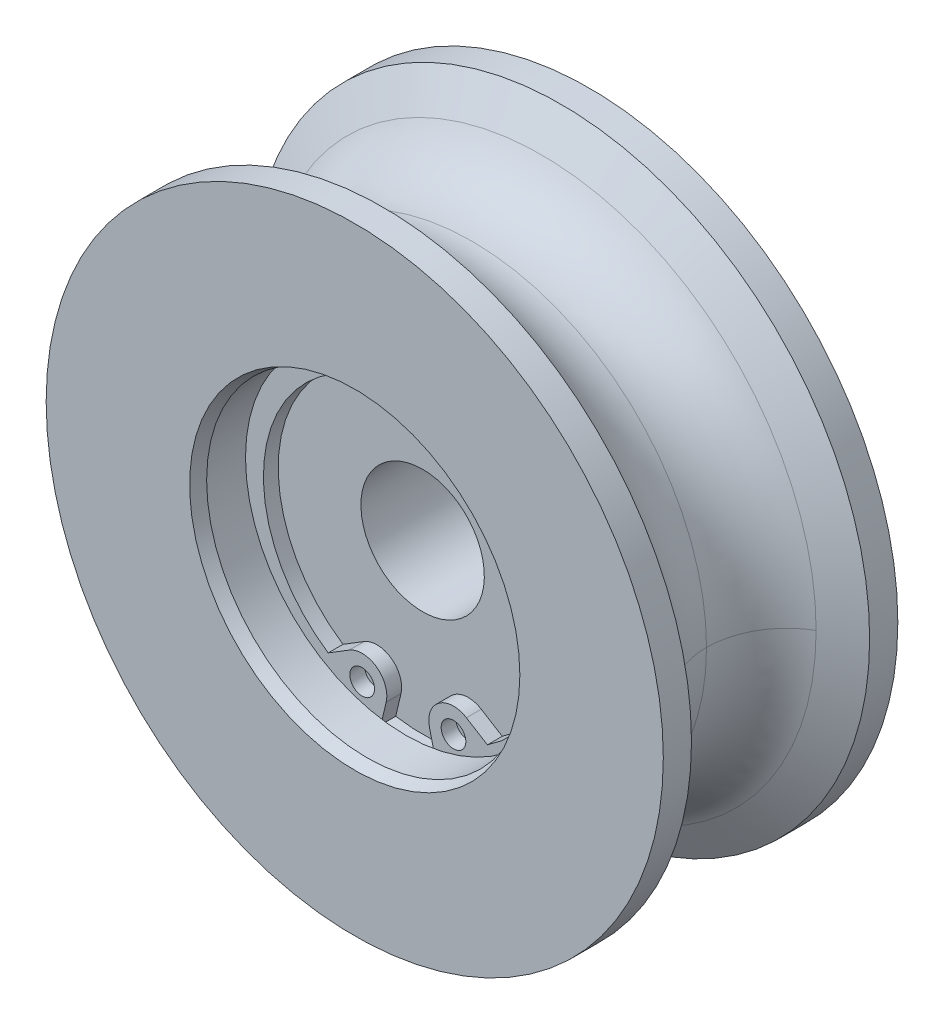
ISO-10303-21;
HEADER;
FILE_DESCRIPTION(('STEP AP214'),'2;1');
FILE_NAME('part.step','',(''),(''),'','','');
FILE_SCHEMA(('AUTOMOTIVE_DESIGN { 1 0 10303 214 1 1 1 1 }'));
ENDSEC;
DATA;
#1=APPLICATION_CONTEXT('core data for automotive mechanical design processes');
#2=APPLICATION_PROTOCOL_DEFINITION('international standard','automotive_design',2000,#1);
#3=PRODUCT_CONTEXT('',#1,'mechanical');
#4=PRODUCT('Part','Part','',(#3));
#5=PRODUCT_RELATED_PRODUCT_CATEGORY('part','',(#4));
#6=PRODUCT_DEFINITION_FORMATION('','',#4);
#7=PRODUCT_DEFINITION_CONTEXT('part definition',#1,'design');
#8=PRODUCT_DEFINITION('design','',#6,#7);
#9=PRODUCT_DEFINITION_SHAPE('','',#8);
#10=(LENGTH_UNIT() NAMED_UNIT(*) SI_UNIT(.MILLI.,.METRE.));
#11=(NAMED_UNIT(*) PLANE_ANGLE_UNIT() SI_UNIT($,.RADIAN.));
#12=(NAMED_UNIT(*) SI_UNIT($,.STERADIAN.) SOLID_ANGLE_UNIT());
#13=UNCERTAINTY_MEASURE_WITH_UNIT(LENGTH_MEASURE(1.E-05),#10,'distance_accuracy_value','');
#14=(GEOMETRIC_REPRESENTATION_CONTEXT(3) GLOBAL_UNCERTAINTY_ASSIGNED_CONTEXT((#13)) GLOBAL_UNIT_ASSIGNED_CONTEXT((#10,
#11,#12)) REPRESENTATION_CONTEXT('',''));
#15=CARTESIAN_POINT('',(0.,0.,0.));
#16=DIRECTION('',(0.,0.,1.));
#17=DIRECTION('',(1.,0.,0.));
#18=AXIS2_PLACEMENT_3D('',#15,#16,#17);
#19=CARTESIAN_POINT('',(0.,-0.75,5.2));
#20=DIRECTION('',(0.,0.,1.));
#21=DIRECTION('',(-1.,0.,0.));
#22=AXIS2_PLACEMENT_3D('',#19,#20,#21);
#23=CYLINDRICAL_SURFACE('',#22,11.7);
#24=CARTESIAN_POINT('',(0.,-0.75,4.));
#25=DIRECTION('',(0.,0.,1.));
#26=DIRECTION('',(0.,-1.,0.));
#27=AXIS2_PLACEMENT_3D('',#24,#25,#26);
#28=CIRCLE('',#27,11.7);
#29=CARTESIAN_POINT('',(6.45127454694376,-10.5106893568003,4.));
#30=VERTEX_POINT('',#29);
#31=CARTESIAN_POINT('',(-6.45127454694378,-10.5106893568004,4.));
#32=VERTEX_POINT('',#31);
#33=EDGE_CURVE('E581',#30,#32,#28,.T.);
#34=ORIENTED_EDGE('',*,*,#33,.F.);
#35=DIRECTION('',(0.,0.,-1.));
#36=VECTOR('',#35,1.);
#37=CARTESIAN_POINT('',(6.45127454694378,-10.5106893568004,5.2));
#38=LINE('',#37,#36);
#39=CARTESIAN_POINT('',(6.45127454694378,-10.5106893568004,5.2));
#40=VERTEX_POINT('',#39);
#41=EDGE_CURVE('E126',#40,#30,#38,.T.);
#42=ORIENTED_EDGE('',*,*,#41,.F.);
#43=CARTESIAN_POINT('',(0.,-0.75,5.2));
#44=DIRECTION('',(0.,0.,-1.));
#45=DIRECTION('',(0.,-1.,0.));
#46=AXIS2_PLACEMENT_3D('',#43,#44,#45);
#47=CIRCLE('',#46,11.7);
#48=CARTESIAN_POINT('',(-6.45127454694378,-10.5106893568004,5.2));
#49=VERTEX_POINT('',#48);
#50=EDGE_CURVE('E134',#49,#40,#47,.T.);
#51=ORIENTED_EDGE('',*,*,#50,.F.);
#52=DIRECTION('',(0.,0.,-1.));
#53=VECTOR('',#52,1.);
#54=CARTESIAN_POINT('',(-6.45127454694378,-10.5106893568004,5.2));
#55=LINE('',#54,#53);
#56=EDGE_CURVE('E107',#49,#32,#55,.T.);
#57=ORIENTED_EDGE('',*,*,#56,.T.);
#58=EDGE_LOOP('',(#34,#42,#51,#57));
#59=FACE_BOUND('',#58,.T.);
#60=ADVANCED_FACE('F14',(#59),#23,.F.);
#61=CARTESIAN_POINT('',(4.74866968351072,-9.46227797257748,5.2));
#62=DIRECTION('',(-0.524334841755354,-0.851512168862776,0.));
#63=DIRECTION('',(-0.851512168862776,0.524334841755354,0.));
#64=AXIS2_PLACEMENT_3D('',#61,#62,#63);
#65=PLANE('',#64);
#66=DIRECTION('',(0.851512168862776,-0.524334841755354,0.));
#67=VECTOR('',#66,1.);
#68=CARTESIAN_POINT('',(-6.73237719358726,-2.39260461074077,4.));
#69=LINE('',#68,#67);
#70=CARTESIAN_POINT('',(4.74866968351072,-9.46227797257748,4.));
#71=VERTEX_POINT('',#70);
#72=EDGE_CURVE('E122',#71,#30,#69,.T.);
#73=ORIENTED_EDGE('',*,*,#72,.F.);
#74=DIRECTION('',(0.,0.,-1.));
#75=VECTOR('',#74,1.);
#76=CARTESIAN_POINT('',(4.74866968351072,-9.46227797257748,5.2));
#77=LINE('',#76,#75);
#78=CARTESIAN_POINT('',(4.74866968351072,-9.46227797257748,5.2));
#79=VERTEX_POINT('',#78);
#80=EDGE_CURVE('E90',#79,#71,#77,.T.);
#81=ORIENTED_EDGE('',*,*,#80,.F.);
#82=DIRECTION('',(-0.851512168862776,0.524334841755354,0.));
#83=VECTOR('',#82,1.);
#84=CARTESIAN_POINT('',(4.74866968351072,-9.46227797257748,5.2));
#85=LINE('',#84,#83);
#86=EDGE_CURVE('E79',#40,#79,#85,.T.);
#87=ORIENTED_EDGE('',*,*,#86,.F.);
#88=ORIENTED_EDGE('',*,*,#41,.T.);
#89=EDGE_LOOP('',(#73,#81,#87,#88));
#90=FACE_BOUND('',#89,.T.);
#91=ADVANCED_FACE('F216',(#90),#65,.F.);
#92=CARTESIAN_POINT('',(3.7,-11.165302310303,5.2));
#93=DIRECTION('',(0.,0.,1.));
#94=DIRECTION('',(-1.,0.,0.));
#95=AXIS2_PLACEMENT_3D('',#92,#93,#94);
#96=CYLINDRICAL_SURFACE('',#95,2.);
#97=CARTESIAN_POINT('',(3.7,-11.165302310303,4.));
#98=DIRECTION('',(0.,0.,1.));
#99=DIRECTION('',(0.,-1.,0.));
#100=AXIS2_PLACEMENT_3D('',#97,#98,#99);
#101=CIRCLE('',#100,2.);
#102=CARTESIAN_POINT('',(1.75425849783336,-11.6280009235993,4.));
#103=VERTEX_POINT('',#102);
#104=EDGE_CURVE('E87',#71,#103,#101,.T.);
#105=ORIENTED_EDGE('',*,*,#104,.T.);
#106=DIRECTION('',(0.,0.,-1.));
#107=VECTOR('',#106,1.);
#108=CARTESIAN_POINT('',(1.75425849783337,-11.6280009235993,5.2));
#109=LINE('',#108,#107);
#110=CARTESIAN_POINT('',(1.75425849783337,-11.6280009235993,5.2));
#111=VERTEX_POINT('',#110);
#112=EDGE_CURVE('E71',#111,#103,#109,.T.);
#113=ORIENTED_EDGE('',*,*,#112,.F.);
#114=CARTESIAN_POINT('',(3.7,-11.165302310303,5.2));
#115=DIRECTION('',(0.,0.,1.));
#116=DIRECTION('',(1.,0.,0.));
#117=AXIS2_PLACEMENT_3D('',#114,#115,#116);
#118=CIRCLE('',#117,2.);
#119=EDGE_CURVE('E73',#79,#111,#118,.T.);
#120=ORIENTED_EDGE('',*,*,#119,.F.);
#121=ORIENTED_EDGE('',*,*,#80,.T.);
#122=EDGE_LOOP('',(#105,#113,#120,#121));
#123=FACE_BOUND('',#122,.T.);
#124=ADVANCED_FACE('F85',(#123),#96,.T.);
#125=CARTESIAN_POINT('',(-1.75425849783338,-11.6280009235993,5.2));
#126=DIRECTION('',(-0.97287075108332,0.231349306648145,0.));
#127=DIRECTION('',(0.,0.,1.));
#128=AXIS2_PLACEMENT_3D('',#125,#126,#127);
#129=PLANE('',#128);
#130=DIRECTION('',(0.,0.,-1.));
#131=VECTOR('',#130,1.);
#132=CARTESIAN_POINT('',(-2.18133072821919,-13.4239262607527,5.35));
#133=LINE('',#132,#131);
#134=CARTESIAN_POINT('',(-2.1813307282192,-13.4239262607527,4.));
#135=VERTEX_POINT('',#134);
#136=CARTESIAN_POINT('',(-2.18133072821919,-13.4239262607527,5.2));
#137=VERTEX_POINT('',#136);
#138=EDGE_CURVE('E108',#135,#137,#133,.F.);
#139=ORIENTED_EDGE('',*,*,#138,.F.);
#140=DIRECTION('',(-0.231349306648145,-0.97287075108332,0.));
#141=VECTOR('',#140,1.);
#142=CARTESIAN_POINT('',(-2.88824186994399,-16.3966309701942,4.));
#143=LINE('',#142,#141);
#144=CARTESIAN_POINT('',(-1.75425849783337,-11.6280009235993,4.));
#145=VERTEX_POINT('',#144);
#146=EDGE_CURVE('E554',#145,#135,#143,.T.);
#147=ORIENTED_EDGE('',*,*,#146,.F.);
#148=DIRECTION('',(0.,0.,-1.));
#149=VECTOR('',#148,1.);
#150=CARTESIAN_POINT('',(-1.75425849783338,-11.6280009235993,5.2));
#151=LINE('',#150,#149);
#152=CARTESIAN_POINT('',(-1.75425849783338,-11.6280009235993,5.2));
#153=VERTEX_POINT('',#152);
#154=EDGE_CURVE('E91',#153,#145,#151,.T.);
#155=ORIENTED_EDGE('',*,*,#154,.F.);
#156=DIRECTION('',(0.231349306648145,0.97287075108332,0.));
#157=VECTOR('',#156,1.);
#158=CARTESIAN_POINT('',(-1.75425849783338,-11.6280009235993,5.2));
#159=LINE('',#158,#157);
#160=EDGE_CURVE('E62',#137,#153,#159,.T.);
#161=ORIENTED_EDGE('',*,*,#160,.F.);
#162=EDGE_LOOP('',(#139,#147,#155,#161));
#163=FACE_BOUND('',#162,.T.);
#164=ADVANCED_FACE('F195',(#163),#129,.F.);
#165=CARTESIAN_POINT('',(0.,-0.75,5.2));
#166=DIRECTION('',(0.,0.,-1.));
#167=DIRECTION('',(0.,-1.,0.));
#168=AXIS2_PLACEMENT_3D('',#165,#166,#167);
#169=PLANE('',#168);
#170=CARTESIAN_POINT('',(3.7,-11.165302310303,5.2));
#171=DIRECTION('',(0.,0.,1.));
#172=DIRECTION('',(1.,0.,0.));
#173=AXIS2_PLACEMENT_3D('',#170,#171,#172);
#174=CIRCLE('',#173,1.);
#175=CARTESIAN_POINT('',(4.7,-11.165302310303,5.2));
#176=VERTEX_POINT('',#175);
#177=EDGE_CURVE('E99',#176,#176,#174,.T.);
#178=ORIENTED_EDGE('',*,*,#177,.F.);
#179=EDGE_LOOP('',(#178));
#180=FACE_BOUND('',#179,.T.);
#181=CARTESIAN_POINT('',(-3.7,-11.165302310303,5.2));
#182=DIRECTION('',(0.,0.,-1.));
#183=DIRECTION('',(1.,0.,0.));
#184=AXIS2_PLACEMENT_3D('',#181,#182,#183);
#185=CIRCLE('',#184,1.);
#186=CARTESIAN_POINT('',(-2.7,-11.165302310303,5.2));
#187=VERTEX_POINT('',#186);
#188=EDGE_CURVE('E96',#187,#187,#185,.T.);
#189=ORIENTED_EDGE('',*,*,#188,.T.);
#190=EDGE_LOOP('',(#189));
#191=FACE_BOUND('',#190,.T.);
#192=CARTESIAN_POINT('',(0.,0.,5.2));
#193=DIRECTION('',(0.,0.,-1.));
#194=DIRECTION('',(-1.,0.,0.));
#195=AXIS2_PLACEMENT_3D('',#192,#193,#194);
#196=CIRCLE('',#195,13.6);
#197=CARTESIAN_POINT('',(2.1813307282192,-13.4239262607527,5.2));
#198=VERTEX_POINT('',#197);
#199=EDGE_CURVE('E22',#137,#198,#196,.T.);
#200=ORIENTED_EDGE('',*,*,#199,.F.);
#201=ORIENTED_EDGE('',*,*,#160,.T.);
#202=CARTESIAN_POINT('',(-3.7,-11.165302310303,5.2));
#203=DIRECTION('',(0.,0.,1.));
#204=DIRECTION('',(-1.,0.,0.));
#205=AXIS2_PLACEMENT_3D('',#202,#203,#204);
#206=CIRCLE('',#205,2.);
#207=CARTESIAN_POINT('',(-4.74866968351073,-9.46227797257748,5.2));
#208=VERTEX_POINT('',#207);
#209=EDGE_CURVE('E131',#153,#208,#206,.T.);
#210=ORIENTED_EDGE('',*,*,#209,.T.);
#211=DIRECTION('',(-0.851512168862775,-0.524334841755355,0.));
#212=VECTOR('',#211,1.);
#213=CARTESIAN_POINT('',(-4.74866968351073,-9.46227797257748,5.2));
#214=LINE('',#213,#212);
#215=EDGE_CURVE('E129',#208,#49,#214,.T.);
#216=ORIENTED_EDGE('',*,*,#215,.T.);
#217=ORIENTED_EDGE('',*,*,#50,.T.);
#218=ORIENTED_EDGE('',*,*,#86,.T.);
#219=ORIENTED_EDGE('',*,*,#119,.T.);
#220=DIRECTION('',(0.231349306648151,-0.972870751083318,0.));
#221=VECTOR('',#220,1.);
#222=CARTESIAN_POINT('',(1.75425849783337,-11.6280009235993,5.2));
#223=LINE('',#222,#221);
#224=EDGE_CURVE('E67',#111,#198,#223,.T.);
#225=ORIENTED_EDGE('',*,*,#224,.T.);
#226=EDGE_LOOP('',(#200,#201,#210,#216,#217,#218,#219,#225));
#227=FACE_BOUND('',#226,.T.);
#228=ADVANCED_FACE('F77',(#180,#191,#227),#169,.F.);
#229=CARTESIAN_POINT('',(3.7,-11.165302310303,5.2));
#230=DIRECTION('',(0.,0.,1.));
#231=DIRECTION('',(-1.,0.,0.));
#232=AXIS2_PLACEMENT_3D('',#229,#230,#231);
#233=CYLINDRICAL_SURFACE('',#232,1.);
#234=CARTESIAN_POINT('',(3.7,-11.165302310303,4.));
#235=DIRECTION('',(0.,0.,1.));
#236=DIRECTION('',(0.,-1.,0.));
#237=AXIS2_PLACEMENT_3D('',#234,#235,#236);
#238=CIRCLE('',#237,1.);
#239=CARTESIAN_POINT('',(3.7,-12.165302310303,4.));
#240=VERTEX_POINT('',#239);
#241=EDGE_CURVE('E563',#240,#240,#238,.T.);
#242=ORIENTED_EDGE('',*,*,#241,.F.);
#243=EDGE_LOOP('',(#242));
#244=FACE_BOUND('',#243,.T.);
#245=ORIENTED_EDGE('',*,*,#177,.T.);
#246=EDGE_LOOP('',(#245));
#247=FACE_BOUND('',#246,.T.);
#248=ADVANCED_FACE('F165',(#244,#247),#233,.F.);
#249=CARTESIAN_POINT('',(-3.7,-11.165302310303,5.2));
#250=DIRECTION('',(0.,0.,1.));
#251=DIRECTION('',(-1.,0.,0.));
#252=AXIS2_PLACEMENT_3D('',#249,#250,#251);
#253=CYLINDRICAL_SURFACE('',#252,1.);
#254=CARTESIAN_POINT('',(-3.7,-11.165302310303,4.));
#255=DIRECTION('',(0.,0.,1.));
#256=DIRECTION('',(0.,-1.,0.));
#257=AXIS2_PLACEMENT_3D('',#254,#255,#256);
#258=CIRCLE('',#257,1.);
#259=CARTESIAN_POINT('',(-3.7,-12.165302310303,4.));
#260=VERTEX_POINT('',#259);
#261=EDGE_CURVE('E566',#260,#260,#258,.T.);
#262=ORIENTED_EDGE('',*,*,#261,.F.);
#263=EDGE_LOOP('',(#262));
#264=FACE_BOUND('',#263,.T.);
#265=ORIENTED_EDGE('',*,*,#188,.F.);
#266=EDGE_LOOP('',(#265));
#267=FACE_BOUND('',#266,.T.);
#268=ADVANCED_FACE('F170',(#264,#267),#253,.F.);
#269=CARTESIAN_POINT('',(-4.74866968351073,-9.46227797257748,5.2));
#270=DIRECTION('',(0.524334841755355,-0.851512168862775,0.));
#271=DIRECTION('',(0.,0.,-1.));
#272=AXIS2_PLACEMENT_3D('',#269,#270,#271);
#273=PLANE('',#272);
#274=DIRECTION('',(0.851512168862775,0.524334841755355,0.));
#275=VECTOR('',#274,1.);
#276=CARTESIAN_POINT('',(-13.2262715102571,-14.6825228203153,4.));
#277=LINE('',#276,#275);
#278=CARTESIAN_POINT('',(-4.74866968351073,-9.46227797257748,4.));
#279=VERTEX_POINT('',#278);
#280=EDGE_CURVE('E577',#32,#279,#277,.T.);
#281=ORIENTED_EDGE('',*,*,#280,.F.);
#282=ORIENTED_EDGE('',*,*,#56,.F.);
#283=ORIENTED_EDGE('',*,*,#215,.F.);
#284=DIRECTION('',(0.,0.,-1.));
#285=VECTOR('',#284,1.);
#286=CARTESIAN_POINT('',(-4.74866968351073,-9.46227797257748,5.2));
#287=LINE('',#286,#285);
#288=EDGE_CURVE('E103',#208,#279,#287,.T.);
#289=ORIENTED_EDGE('',*,*,#288,.T.);
#290=EDGE_LOOP('',(#281,#282,#283,#289));
#291=FACE_BOUND('',#290,.T.);
#292=ADVANCED_FACE('F180',(#291),#273,.F.);
#293=CARTESIAN_POINT('',(-3.7,-11.165302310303,5.2));
#294=DIRECTION('',(0.,0.,1.));
#295=DIRECTION('',(-1.,0.,0.));
#296=AXIS2_PLACEMENT_3D('',#293,#294,#295);
#297=CYLINDRICAL_SURFACE('',#296,2.);
#298=CARTESIAN_POINT('',(-3.7,-11.165302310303,4.));
#299=DIRECTION('',(0.,0.,1.));
#300=DIRECTION('',(0.,-1.,0.));
#301=AXIS2_PLACEMENT_3D('',#298,#299,#300);
#302=CIRCLE('',#301,2.);
#303=EDGE_CURVE('E571',#145,#279,#302,.T.);
#304=ORIENTED_EDGE('',*,*,#303,.T.);
#305=ORIENTED_EDGE('',*,*,#288,.F.);
#306=ORIENTED_EDGE('',*,*,#209,.F.);
#307=ORIENTED_EDGE('',*,*,#154,.T.);
#308=EDGE_LOOP('',(#304,#305,#306,#307));
#309=FACE_BOUND('',#308,.T.);
#310=ADVANCED_FACE('F186',(#309),#297,.T.);
#311=CARTESIAN_POINT('',(1.75425849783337,-11.6280009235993,5.2));
#312=DIRECTION('',(0.972870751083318,0.231349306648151,0.));
#313=DIRECTION('',(0.,0.,-1.));
#314=AXIS2_PLACEMENT_3D('',#311,#312,#313);
#315=PLANE('',#314);
#316=DIRECTION('',(0.,0.,-1.));
#317=VECTOR('',#316,1.);
#318=CARTESIAN_POINT('',(2.1813307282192,-13.4239262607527,5.35));
#319=LINE('',#318,#317);
#320=CARTESIAN_POINT('',(2.18133072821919,-13.4239262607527,4.));
#321=VERTEX_POINT('',#320);
#322=EDGE_CURVE('E9',#198,#321,#319,.T.);
#323=ORIENTED_EDGE('',*,*,#322,.F.);
#324=ORIENTED_EDGE('',*,*,#224,.F.);
#325=ORIENTED_EDGE('',*,*,#112,.T.);
#326=DIRECTION('',(-0.231349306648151,0.972870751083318,0.));
#327=VECTOR('',#326,1.);
#328=CARTESIAN_POINT('',(1.41496007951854,-10.2011822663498,4.));
#329=LINE('',#328,#327);
#330=EDGE_CURVE('E109',#321,#103,#329,.T.);
#331=ORIENTED_EDGE('',*,*,#330,.F.);
#332=EDGE_LOOP('',(#323,#324,#325,#331));
#333=FACE_BOUND('',#332,.T.);
#334=ADVANCED_FACE('F69',(#333),#315,.F.);
#335=CARTESIAN_POINT('',(-13.7632,-13.81055875,4.));
#336=DIRECTION('',(0.,0.,1.));
#337=DIRECTION('',(1.,0.,0.));
#338=AXIS2_PLACEMENT_3D('',#335,#336,#337);
#339=PLANE('',#338);
#340=ORIENTED_EDGE('',*,*,#241,.T.);
#341=EDGE_LOOP('',(#340));
#342=FACE_BOUND('',#341,.T.);
#343=ADVANCED_FACE('F207',(#342),#339,.T.);
#344=ORIENTED_EDGE('',*,*,#261,.T.);
#345=EDGE_LOOP('',(#344));
#346=FACE_BOUND('',#345,.T.);
#347=ADVANCED_FACE('F209',(#346),#339,.T.);
#348=CARTESIAN_POINT('',(22.25,0.,5.629165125));
#349=CARTESIAN_POINT('',(22.25,-44.5,5.62916512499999));
#350=CARTESIAN_POINT('',(-22.25,-44.5,5.62916512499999));
#351=CARTESIAN_POINT('',(-22.25,0.,5.629165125));
#352=CARTESIAN_POINT('',(20.189582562,0.,4.43958256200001));
#353=CARTESIAN_POINT('',(20.189582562,-40.379165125,4.439582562));
#354=CARTESIAN_POINT('',(-20.189582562,-40.379165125,4.439582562));
#355=CARTESIAN_POINT('',(-20.189582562,0.,4.43958256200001));
#356=CARTESIAN_POINT('',(19.,0.,2.37916512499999));
#357=CARTESIAN_POINT('',(19.,-38.,2.37916512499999));
#358=CARTESIAN_POINT('',(-19.,-38.,2.37916512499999));
#359=CARTESIAN_POINT('',(-19.,0.,2.37916512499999));
#360=CARTESIAN_POINT('',(19.,0.,0.));
#361=CARTESIAN_POINT('',(19.,-38.,0.));
#362=CARTESIAN_POINT('',(-19.,-38.,0.));
#363=CARTESIAN_POINT('',(-19.,0.,0.));
#364=(BOUNDED_SURFACE() B_SPLINE_SURFACE(3,3,((#348,#349,#350,#351),(#352,#353,#354,#355),(#356,
#357,#358,#359),(#360,#361,#362,#363)),.UNSPECIFIED.,.F.,.F.,
.F.) B_SPLINE_SURFACE_WITH_KNOTS((4,4),(4,4),(0.,1.),(0.,1.),
.UNSPECIFIED.) GEOMETRIC_REPRESENTATION_ITEM() RATIONAL_B_SPLINE_SURFACE(((1.,0.333333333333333,
0.333333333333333,1.),(0.91068360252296,0.303561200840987,0.303561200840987,0.91068360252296),
(0.91068360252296,0.303561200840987,0.303561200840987,0.91068360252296),(1.,0.333333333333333,
0.333333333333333,1.))) REPRESENTATION_ITEM('') SURFACE());
#365=CARTESIAN_POINT('',(22.25,0.,5.629165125));
#366=CARTESIAN_POINT('',(20.189582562,0.,4.43958256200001));
#367=CARTESIAN_POINT('',(19.,0.,2.37916512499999));
#368=CARTESIAN_POINT('',(19.,0.,0.));
#369=(BOUNDED_CURVE() B_SPLINE_CURVE(3,(#365,#366,#367,#368),.UNSPECIFIED.,.F.,
.F.) B_SPLINE_CURVE_WITH_KNOTS((4,4),(0.,1.),
.UNSPECIFIED.) CURVE() GEOMETRIC_REPRESENTATION_ITEM() RATIONAL_B_SPLINE_CURVE((1.,
0.91068360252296,0.91068360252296,1.)) REPRESENTATION_ITEM(''));
#370=CARTESIAN_POINT('',(19.,0.,0.));
#371=VERTEX_POINT('',#370);
#372=CARTESIAN_POINT('',(22.25,-1.99790782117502E-09,5.62916512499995));
#373=VERTEX_POINT('',#372);
#374=EDGE_CURVE('E632',#371,#373,#369,.F.);
#375=CARTESIAN_POINT('',(0.,0.,5.629165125));
#376=DIRECTION('',(0.,0.,1.));
#377=DIRECTION('',(1.,0.,0.));
#378=AXIS2_PLACEMENT_3D('',#375,#376,#377);
#379=CIRCLE('',#378,22.25);
#380=CARTESIAN_POINT('',(-22.25,-6.84532651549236E-09,5.62916512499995));
#381=VERTEX_POINT('',#380);
#382=EDGE_CURVE('E627',#381,#373,#379,.T.);
#383=CARTESIAN_POINT('',(-22.25,0.,5.629165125));
#384=CARTESIAN_POINT('',(-20.189582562,0.,4.43958256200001));
#385=CARTESIAN_POINT('',(-19.,0.,2.37916512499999));
#386=CARTESIAN_POINT('',(-19.,0.,0.));
#387=(BOUNDED_CURVE() B_SPLINE_CURVE(3,(#383,#384,#385,#386),.UNSPECIFIED.,.F.,
.F.) B_SPLINE_CURVE_WITH_KNOTS((4,4),(0.,1.),
.UNSPECIFIED.) CURVE() GEOMETRIC_REPRESENTATION_ITEM() RATIONAL_B_SPLINE_CURVE((1.,
0.91068360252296,0.91068360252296,1.)) REPRESENTATION_ITEM(''));
#388=CARTESIAN_POINT('',(-19.,0.,0.));
#389=VERTEX_POINT('',#388);
#390=EDGE_CURVE('E630',#381,#389,#387,.T.);
#391=CARTESIAN_POINT('',(0.,0.,0.));
#392=DIRECTION('',(0.,0.,1.));
#393=DIRECTION('',(1.,0.,0.));
#394=AXIS2_PLACEMENT_3D('',#391,#392,#393);
#395=CIRCLE('',#394,19.);
#396=EDGE_CURVE('E652',#389,#371,#395,.T.);
#397=ORIENTED_EDGE('',*,*,#374,.T.);
#398=ORIENTED_EDGE('',*,*,#382,.F.);
#399=ORIENTED_EDGE('',*,*,#390,.T.);
#400=ORIENTED_EDGE('',*,*,#396,.T.);
#401=EDGE_LOOP('',(#397,#398,#399,#400));
#402=FACE_BOUND('',#401,.T.);
#403=ADVANCED_FACE('F304',(#402),#364,.F.);
#404=CARTESIAN_POINT('',(-22.25,0.,5.629165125));
#405=CARTESIAN_POINT('',(-22.25,44.5,5.62916512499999));
#406=CARTESIAN_POINT('',(22.25,44.5,5.62916512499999));
#407=CARTESIAN_POINT('',(22.25,0.,5.629165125));
#408=CARTESIAN_POINT('',(-20.189582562,0.,4.43958256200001));
#409=CARTESIAN_POINT('',(-20.189582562,40.379165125,4.43958256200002));
#410=CARTESIAN_POINT('',(20.189582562,40.379165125,4.43958256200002));
#411=CARTESIAN_POINT('',(20.189582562,0.,4.43958256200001));
#412=CARTESIAN_POINT('',(-19.,0.,2.37916512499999));
#413=CARTESIAN_POINT('',(-19.,38.,2.37916512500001));
#414=CARTESIAN_POINT('',(19.,38.,2.37916512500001));
#415=CARTESIAN_POINT('',(19.,0.,2.37916512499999));
#416=CARTESIAN_POINT('',(-19.,0.,0.));
#417=CARTESIAN_POINT('',(-19.,38.,0.));
#418=CARTESIAN_POINT('',(19.,38.,0.));
#419=CARTESIAN_POINT('',(19.,0.,0.));
#420=(BOUNDED_SURFACE() B_SPLINE_SURFACE(3,3,((#404,#405,#406,#407),(#408,#409,#410,#411),(#412,
#413,#414,#415),(#416,#417,#418,#419)),.UNSPECIFIED.,.F.,.F.,
.F.) B_SPLINE_SURFACE_WITH_KNOTS((4,4),(4,4),(0.,1.),(0.,1.),
.UNSPECIFIED.) GEOMETRIC_REPRESENTATION_ITEM() RATIONAL_B_SPLINE_SURFACE(((1.,0.333333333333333,
0.333333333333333,1.),(0.91068360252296,0.303561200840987,0.303561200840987,0.91068360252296),
(0.91068360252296,0.303561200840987,0.303561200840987,0.91068360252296),(1.,0.333333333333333,
0.333333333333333,1.))) REPRESENTATION_ITEM('') SURFACE());
#421=CARTESIAN_POINT('',(0.,0.,5.629165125));
#422=DIRECTION('',(0.,0.,1.));
#423=DIRECTION('',(1.,0.,0.));
#424=AXIS2_PLACEMENT_3D('',#421,#422,#423);
#425=CIRCLE('',#424,22.25);
#426=EDGE_CURVE('E640',#373,#381,#425,.T.);
#427=CARTESIAN_POINT('',(0.,0.,0.));
#428=DIRECTION('',(0.,0.,1.));
#429=DIRECTION('',(1.,0.,0.));
#430=AXIS2_PLACEMENT_3D('',#427,#428,#429);
#431=CIRCLE('',#430,19.);
#432=EDGE_CURVE('E642',#371,#389,#431,.T.);
#433=ORIENTED_EDGE('',*,*,#390,.F.);
#434=ORIENTED_EDGE('',*,*,#426,.F.);
#435=ORIENTED_EDGE('',*,*,#374,.F.);
#436=ORIENTED_EDGE('',*,*,#432,.T.);
#437=EDGE_LOOP('',(#433,#434,#435,#436));
#438=FACE_BOUND('',#437,.T.);
#439=ADVANCED_FACE('F312',(#438),#420,.F.);
#440=CARTESIAN_POINT('',(19.,0.,0.));
#441=CARTESIAN_POINT('',(19.,-38.,0.));
#442=CARTESIAN_POINT('',(-19.,-38.,0.));
#443=CARTESIAN_POINT('',(-19.,0.,0.));
#444=CARTESIAN_POINT('',(19.,0.,-2.379165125));
#445=CARTESIAN_POINT('',(19.,-38.,-2.37916512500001));
#446=CARTESIAN_POINT('',(-19.,-38.,-2.37916512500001));
#447=CARTESIAN_POINT('',(-19.,0.,-2.379165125));
#448=CARTESIAN_POINT('',(20.189582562,0.,-4.439582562));
#449=CARTESIAN_POINT('',(20.189582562,-40.379165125,-4.439582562));
#450=CARTESIAN_POINT('',(-20.189582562,-40.379165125,-4.439582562));
#451=CARTESIAN_POINT('',(-20.189582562,0.,-4.439582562));
#452=CARTESIAN_POINT('',(22.25,0.,-5.629165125));
#453=CARTESIAN_POINT('',(22.25,-44.5,-5.62916512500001));
#454=CARTESIAN_POINT('',(-22.25,-44.5,-5.62916512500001));
#455=CARTESIAN_POINT('',(-22.25,0.,-5.629165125));
#456=(BOUNDED_SURFACE() B_SPLINE_SURFACE(3,3,((#440,#441,#442,#443),(#444,#445,#446,#447),(#448,
#449,#450,#451),(#452,#453,#454,#455)),.UNSPECIFIED.,.F.,.F.,
.F.) B_SPLINE_SURFACE_WITH_KNOTS((4,4),(4,4),(0.,1.),(0.,1.),
.UNSPECIFIED.) GEOMETRIC_REPRESENTATION_ITEM() RATIONAL_B_SPLINE_SURFACE(((1.,0.333333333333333,
0.333333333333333,1.),(0.910683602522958,0.303561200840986,0.303561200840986,0.910683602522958),
(0.910683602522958,0.303561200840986,0.303561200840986,0.910683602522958),(1.,0.333333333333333,
0.333333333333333,1.))) REPRESENTATION_ITEM('') SURFACE());
#457=CARTESIAN_POINT('',(-19.,0.,0.));
#458=CARTESIAN_POINT('',(-19.,0.,-2.379165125));
#459=CARTESIAN_POINT('',(-20.189582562,0.,-4.439582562));
#460=CARTESIAN_POINT('',(-22.25,0.,-5.629165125));
#461=(BOUNDED_CURVE() B_SPLINE_CURVE(3,(#457,#458,#459,#460),.UNSPECIFIED.,.F.,
.F.) B_SPLINE_CURVE_WITH_KNOTS((4,4),(0.,1.),
.UNSPECIFIED.) CURVE() GEOMETRIC_REPRESENTATION_ITEM() RATIONAL_B_SPLINE_CURVE((1.,
0.910683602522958,0.910683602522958,1.)) REPRESENTATION_ITEM(''));
#462=CARTESIAN_POINT('',(-22.25,-1.99790586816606E-09,-5.62916512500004));
#463=VERTEX_POINT('',#462);
#464=EDGE_CURVE('E567',#389,#463,#461,.T.);
#465=CARTESIAN_POINT('',(0.,0.,-5.629165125));
#466=DIRECTION('',(0.,0.,-1.));
#467=DIRECTION('',(-1.,0.,0.));
#468=AXIS2_PLACEMENT_3D('',#465,#466,#467);
#469=CIRCLE('',#468,22.25);
#470=CARTESIAN_POINT('',(22.25,-6.84532456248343E-09,-5.62916512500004));
#471=VERTEX_POINT('',#470);
#472=EDGE_CURVE('E643',#471,#463,#469,.T.);
#473=CARTESIAN_POINT('',(19.,0.,0.));
#474=CARTESIAN_POINT('',(19.,0.,-2.379165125));
#475=CARTESIAN_POINT('',(20.189582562,0.,-4.439582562));
#476=CARTESIAN_POINT('',(22.25,0.,-5.629165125));
#477=(BOUNDED_CURVE() B_SPLINE_CURVE(3,(#473,#474,#475,#476),.UNSPECIFIED.,.F.,
.F.) B_SPLINE_CURVE_WITH_KNOTS((4,4),(0.,1.),
.UNSPECIFIED.) CURVE() GEOMETRIC_REPRESENTATION_ITEM() RATIONAL_B_SPLINE_CURVE((1.,
0.910683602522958,0.910683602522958,1.)) REPRESENTATION_ITEM(''));
#478=EDGE_CURVE('E668',#471,#371,#477,.F.);
#479=ORIENTED_EDGE('',*,*,#396,.F.);
#480=ORIENTED_EDGE('',*,*,#464,.T.);
#481=ORIENTED_EDGE('',*,*,#472,.F.);
#482=ORIENTED_EDGE('',*,*,#478,.T.);
#483=EDGE_LOOP('',(#479,#480,#481,#482));
#484=FACE_BOUND('',#483,.T.);
#485=ADVANCED_FACE('F321',(#484),#456,.F.);
#486=CARTESIAN_POINT('',(-19.,0.,0.));
#487=CARTESIAN_POINT('',(-19.,38.,0.));
#488=CARTESIAN_POINT('',(19.,38.,0.));
#489=CARTESIAN_POINT('',(19.,0.,0.));
#490=CARTESIAN_POINT('',(-19.,0.,-2.379165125));
#491=CARTESIAN_POINT('',(-19.,38.,-2.37916512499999));
#492=CARTESIAN_POINT('',(19.,38.,-2.37916512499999));
#493=CARTESIAN_POINT('',(19.,0.,-2.379165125));
#494=CARTESIAN_POINT('',(-20.189582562,0.,-4.439582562));
#495=CARTESIAN_POINT('',(-20.189582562,40.379165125,-4.43958256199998));
#496=CARTESIAN_POINT('',(20.189582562,40.379165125,-4.43958256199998));
#497=CARTESIAN_POINT('',(20.189582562,0.,-4.439582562));
#498=CARTESIAN_POINT('',(-22.25,0.,-5.629165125));
#499=CARTESIAN_POINT('',(-22.25,44.5,-5.62916512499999));
#500=CARTESIAN_POINT('',(22.25,44.5,-5.62916512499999));
#501=CARTESIAN_POINT('',(22.25,0.,-5.629165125));
#502=(BOUNDED_SURFACE() B_SPLINE_SURFACE(3,3,((#486,#487,#488,#489),(#490,#491,#492,#493),(#494,
#495,#496,#497),(#498,#499,#500,#501)),.UNSPECIFIED.,.F.,.F.,
.F.) B_SPLINE_SURFACE_WITH_KNOTS((4,4),(4,4),(0.,1.),(0.,1.),
.UNSPECIFIED.) GEOMETRIC_REPRESENTATION_ITEM() RATIONAL_B_SPLINE_SURFACE(((1.,0.333333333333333,
0.333333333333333,1.),(0.910683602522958,0.303561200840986,0.303561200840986,0.910683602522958),
(0.910683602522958,0.303561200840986,0.303561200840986,0.910683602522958),(1.,0.333333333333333,
0.333333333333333,1.))) REPRESENTATION_ITEM('') SURFACE());
#503=CARTESIAN_POINT('',(0.,0.,-5.629165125));
#504=DIRECTION('',(0.,0.,-1.));
#505=DIRECTION('',(-1.,0.,0.));
#506=AXIS2_PLACEMENT_3D('',#503,#504,#505);
#507=CIRCLE('',#506,22.25);
#508=EDGE_CURVE('E657',#463,#471,#507,.T.);
#509=ORIENTED_EDGE('',*,*,#432,.F.);
#510=ORIENTED_EDGE('',*,*,#478,.F.);
#511=ORIENTED_EDGE('',*,*,#508,.F.);
#512=ORIENTED_EDGE('',*,*,#464,.F.);
#513=EDGE_LOOP('',(#509,#510,#511,#512));
#514=FACE_BOUND('',#513,.T.);
#515=ADVANCED_FACE('F330',(#514),#502,.F.);
#516=CARTESIAN_POINT('',(0.,0.,5.629165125));
#517=DIRECTION('',(0.,0.,1.));
#518=DIRECTION('',(1.,0.,0.));
#519=AXIS2_PLACEMENT_3D('',#516,#517,#518);
#520=CONICAL_SURFACE('',#519,22.25,1.04719755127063);
#521=CARTESIAN_POINT('',(0.,0.,7.2168783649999));
#522=DIRECTION('',(0.,0.,1.));
#523=DIRECTION('',(1.,0.,0.));
#524=AXIS2_PLACEMENT_3D('',#521,#522,#523);
#525=CIRCLE('',#524,25.);
#526=CARTESIAN_POINT('',(25.,0.,7.216878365));
#527=VERTEX_POINT('',#526);
#528=EDGE_CURVE('E637',#527,#527,#525,.F.);
#529=ORIENTED_EDGE('',*,*,#528,.T.);
#530=EDGE_LOOP('',(#529));
#531=FACE_BOUND('',#530,.T.);
#532=ORIENTED_EDGE('',*,*,#426,.T.);
#533=ORIENTED_EDGE('',*,*,#382,.T.);
#534=EDGE_LOOP('',(#532,#533));
#535=FACE_BOUND('',#534,.T.);
#536=ADVANCED_FACE('F339',(#531,#535),#520,.T.);
#537=CARTESIAN_POINT('',(0.,0.,-5.629165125));
#538=DIRECTION('',(0.,0.,-1.));
#539=DIRECTION('',(-1.,0.,0.));
#540=AXIS2_PLACEMENT_3D('',#537,#538,#539);
#541=CONICAL_SURFACE('',#540,22.25,1.04719755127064);
#542=CARTESIAN_POINT('',(0.,0.,-7.21687836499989));
#543=DIRECTION('',(0.,0.,-1.));
#544=DIRECTION('',(-1.,0.,0.));
#545=AXIS2_PLACEMENT_3D('',#542,#543,#544);
#546=CIRCLE('',#545,25.);
#547=CARTESIAN_POINT('',(-25.,0.,-7.216878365));
#548=VERTEX_POINT('',#547);
#549=EDGE_CURVE('E636',#548,#548,#546,.F.);
#550=ORIENTED_EDGE('',*,*,#549,.T.);
#551=EDGE_LOOP('',(#550));
#552=FACE_BOUND('',#551,.T.);
#553=ORIENTED_EDGE('',*,*,#508,.T.);
#554=ORIENTED_EDGE('',*,*,#472,.T.);
#555=EDGE_LOOP('',(#553,#554));
#556=FACE_BOUND('',#555,.T.);
#557=ADVANCED_FACE('F348',(#552,#556),#541,.T.);
#558=CARTESIAN_POINT('',(0.,0.,9.5));
#559=DIRECTION('',(0.,0.,-1.));
#560=DIRECTION('',(-1.,0.,0.));
#561=AXIS2_PLACEMENT_3D('',#558,#559,#560);
#562=CYLINDRICAL_SURFACE('',#561,25.);
#563=ORIENTED_EDGE('',*,*,#528,.F.);
#564=EDGE_LOOP('',(#563));
#565=FACE_BOUND('',#564,.T.);
#566=CARTESIAN_POINT('',(0.,0.,9.5));
#567=DIRECTION('',(0.,0.,-1.));
#568=DIRECTION('',(-1.,0.,0.));
#569=AXIS2_PLACEMENT_3D('',#566,#567,#568);
#570=CIRCLE('',#569,25.);
#571=CARTESIAN_POINT('',(-25.,0.,9.5));
#572=VERTEX_POINT('',#571);
#573=EDGE_CURVE('E688',#572,#572,#570,.T.);
#574=ORIENTED_EDGE('',*,*,#573,.T.);
#575=EDGE_LOOP('',(#574));
#576=FACE_BOUND('',#575,.T.);
#577=ADVANCED_FACE('F357',(#565,#576),#562,.T.);
#578=CARTESIAN_POINT('',(0.,0.,-7.216878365));
#579=DIRECTION('',(0.,0.,-1.));
#580=DIRECTION('',(-1.,0.,0.));
#581=AXIS2_PLACEMENT_3D('',#578,#579,#580);
#582=CYLINDRICAL_SURFACE('',#581,25.);
#583=CARTESIAN_POINT('',(0.,0.,-9.5));
#584=DIRECTION('',(0.,0.,-1.));
#585=DIRECTION('',(-1.,0.,0.));
#586=AXIS2_PLACEMENT_3D('',#583,#584,#585);
#587=CIRCLE('',#586,25.);
#588=CARTESIAN_POINT('',(-25.,0.,-9.5));
#589=VERTEX_POINT('',#588);
#590=EDGE_CURVE('E685',#589,#589,#587,.F.);
#591=ORIENTED_EDGE('',*,*,#590,.T.);
#592=EDGE_LOOP('',(#591));
#593=FACE_BOUND('',#592,.T.);
#594=ORIENTED_EDGE('',*,*,#549,.F.);
#595=EDGE_LOOP('',(#594));
#596=FACE_BOUND('',#595,.T.);
#597=ADVANCED_FACE('F366',(#593,#596),#582,.T.);
#598=CARTESIAN_POINT('',(-25.3,-25.387056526,9.5));
#599=DIRECTION('',(0.,0.,1.));
#600=DIRECTION('',(1.,0.,0.));
#601=AXIS2_PLACEMENT_3D('',#598,#599,#600);
#602=PLANE('',#601);
#603=CARTESIAN_POINT('',(0.,0.,9.5));
#604=DIRECTION('',(0.,0.,1.));
#605=DIRECTION('',(1.,0.,0.));
#606=AXIS2_PLACEMENT_3D('',#603,#604,#605);
#607=CIRCLE('',#606,13.377350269);
#608=CARTESIAN_POINT('',(13.377350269,0.,9.5));
#609=VERTEX_POINT('',#608);
#610=EDGE_CURVE('E694',#609,#609,#607,.F.);
#611=ORIENTED_EDGE('',*,*,#610,.T.);
#612=EDGE_LOOP('',(#611));
#613=FACE_BOUND('',#612,.T.);
#614=ORIENTED_EDGE('',*,*,#573,.F.);
#615=EDGE_LOOP('',(#614));
#616=FACE_BOUND('',#615,.T.);
#617=ADVANCED_FACE('F375',(#613,#616),#602,.T.);
#618=CARTESIAN_POINT('',(25.3,-25.387056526,-9.5));
#619=DIRECTION('',(0.,0.,-1.));
#620=DIRECTION('',(-1.,0.,0.));
#621=AXIS2_PLACEMENT_3D('',#618,#619,#620);
#622=PLANE('',#621);
#623=CARTESIAN_POINT('',(0.,0.,-9.5));
#624=DIRECTION('',(0.,0.,-1.));
#625=DIRECTION('',(-1.,0.,0.));
#626=AXIS2_PLACEMENT_3D('',#623,#624,#625);
#627=CIRCLE('',#626,11.);
#628=CARTESIAN_POINT('',(-11.,0.,-9.5));
#629=VERTEX_POINT('',#628);
#630=EDGE_CURVE('E691',#629,#629,#627,.F.);
#631=ORIENTED_EDGE('',*,*,#630,.T.);
#632=EDGE_LOOP('',(#631));
#633=FACE_BOUND('',#632,.T.);
#634=ORIENTED_EDGE('',*,*,#590,.F.);
#635=EDGE_LOOP('',(#634));
#636=FACE_BOUND('',#635,.T.);
#637=ADVANCED_FACE('F384',(#633,#636),#622,.T.);
#638=CARTESIAN_POINT('',(0.,0.,8.5));
#639=DIRECTION('',(0.,0.,1.));
#640=DIRECTION('',(1.,0.,0.));
#641=AXIS2_PLACEMENT_3D('',#638,#639,#640);
#642=CONICAL_SURFACE('',#641,13.,0.360829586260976);
#643=CARTESIAN_POINT('',(0.,0.,8.5));
#644=DIRECTION('',(0.,0.,1.));
#645=DIRECTION('',(1.,0.,0.));
#646=AXIS2_PLACEMENT_3D('',#643,#644,#645);
#647=CIRCLE('',#646,13.);
#648=CARTESIAN_POINT('',(13.,0.,8.49999999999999));
#649=VERTEX_POINT('',#648);
#650=EDGE_CURVE('E680',#649,#649,#647,.T.);
#651=ORIENTED_EDGE('',*,*,#650,.F.);
#652=EDGE_LOOP('',(#651));
#653=FACE_BOUND('',#652,.T.);
#654=ORIENTED_EDGE('',*,*,#610,.F.);
#655=EDGE_LOOP('',(#654));
#656=FACE_BOUND('',#655,.T.);
#657=ADVANCED_FACE('F393',(#653,#656),#642,.F.);
#658=CARTESIAN_POINT('',(0.,0.,-4.));
#659=DIRECTION('',(0.,0.,-1.));
#660=DIRECTION('',(-1.,0.,0.));
#661=AXIS2_PLACEMENT_3D('',#658,#659,#660);
#662=CYLINDRICAL_SURFACE('',#661,11.);
#663=ORIENTED_EDGE('',*,*,#630,.F.);
#664=EDGE_LOOP('',(#663));
#665=FACE_BOUND('',#664,.T.);
#666=CARTESIAN_POINT('',(0.,0.,-4.));
#667=DIRECTION('',(0.,0.,-1.));
#668=DIRECTION('',(-1.,0.,0.));
#669=AXIS2_PLACEMENT_3D('',#666,#667,#668);
#670=CIRCLE('',#669,11.);
#671=CARTESIAN_POINT('',(-11.,0.,-4.));
#672=VERTEX_POINT('',#671);
#673=EDGE_CURVE('E683',#672,#672,#670,.T.);
#674=ORIENTED_EDGE('',*,*,#673,.F.);
#675=EDGE_LOOP('',(#674));
#676=FACE_BOUND('',#675,.T.);
#677=ADVANCED_FACE('F402',(#665,#676),#662,.F.);
#678=CARTESIAN_POINT('',(0.,0.,8.5));
#679=DIRECTION('',(0.,0.,-1.));
#680=DIRECTION('',(-1.,0.,0.));
#681=AXIS2_PLACEMENT_3D('',#678,#679,#680);
#682=CYLINDRICAL_SURFACE('',#681,13.);
#683=ORIENTED_EDGE('',*,*,#650,.T.);
#684=EDGE_LOOP('',(#683));
#685=FACE_BOUND('',#684,.T.);
#686=CARTESIAN_POINT('',(0.,0.,5.35));
#687=DIRECTION('',(0.,0.,-1.));
#688=DIRECTION('',(-1.,0.,0.));
#689=AXIS2_PLACEMENT_3D('',#686,#687,#688);
#690=CIRCLE('',#689,13.);
#691=CARTESIAN_POINT('',(-13.,0.,5.35));
#692=VERTEX_POINT('',#691);
#693=EDGE_CURVE('E701',#692,#692,#690,.F.);
#694=ORIENTED_EDGE('',*,*,#693,.F.);
#695=EDGE_LOOP('',(#694));
#696=FACE_BOUND('',#695,.T.);
#697=ADVANCED_FACE('F411',(#685,#696),#682,.F.);
#698=CARTESIAN_POINT('',(11.132,-11.170304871,-4.));
#699=DIRECTION('',(0.,0.,-1.));
#700=DIRECTION('',(-1.,0.,0.));
#701=AXIS2_PLACEMENT_3D('',#698,#699,#700);
#702=PLANE('',#701);
#703=CARTESIAN_POINT('',(0.,0.,-4.));
#704=DIRECTION('',(0.,0.,-1.));
#705=DIRECTION('',(0.,1.,0.));
#706=AXIS2_PLACEMENT_3D('',#703,#704,#705);
#707=CIRCLE('',#706,5.);
#708=CARTESIAN_POINT('',(0.,5.,-4.));
#709=VERTEX_POINT('',#708);
#710=EDGE_CURVE('E684',#709,#709,#707,.F.);
#711=ORIENTED_EDGE('',*,*,#710,.T.);
#712=EDGE_LOOP('',(#711));
#713=FACE_BOUND('',#712,.T.);
#714=ORIENTED_EDGE('',*,*,#673,.T.);
#715=EDGE_LOOP('',(#714));
#716=FACE_BOUND('',#715,.T.);
#717=ADVANCED_FACE('F420',(#713,#716),#702,.T.);
#718=CARTESIAN_POINT('',(13.7632,-13.81055875,5.35));
#719=DIRECTION('',(0.,0.,-1.));
#720=DIRECTION('',(-1.,0.,0.));
#721=AXIS2_PLACEMENT_3D('',#718,#719,#720);
#722=PLANE('',#721);
#723=ORIENTED_EDGE('',*,*,#693,.T.);
#724=EDGE_LOOP('',(#723));
#725=FACE_BOUND('',#724,.T.);
#726=CARTESIAN_POINT('',(0.,0.,5.35));
#727=DIRECTION('',(0.,0.,-1.));
#728=DIRECTION('',(-1.,0.,0.));
#729=AXIS2_PLACEMENT_3D('',#726,#727,#728);
#730=CIRCLE('',#729,13.6);
#731=CARTESIAN_POINT('',(-13.6,0.,5.35));
#732=VERTEX_POINT('',#731);
#733=EDGE_CURVE('E557',#732,#732,#730,.T.);
#734=ORIENTED_EDGE('',*,*,#733,.T.);
#735=EDGE_LOOP('',(#734));
#736=FACE_BOUND('',#735,.T.);
#737=ADVANCED_FACE('F429',(#725,#736),#722,.T.);
#738=CARTESIAN_POINT('',(0.,0.,5.35));
#739=DIRECTION('',(0.,0.,-1.));
#740=DIRECTION('',(-1.,0.,0.));
#741=AXIS2_PLACEMENT_3D('',#738,#739,#740);
#742=CYLINDRICAL_SURFACE('',#741,13.6);
#743=ORIENTED_EDGE('',*,*,#733,.F.);
#744=EDGE_LOOP('',(#743));
#745=FACE_BOUND('',#744,.T.);
#746=ORIENTED_EDGE('',*,*,#199,.T.);
#747=ORIENTED_EDGE('',*,*,#322,.T.);
#748=CARTESIAN_POINT('',(0.,0.,4.));
#749=DIRECTION('',(0.,0.,-1.));
#750=DIRECTION('',(-1.,0.,0.));
#751=AXIS2_PLACEMENT_3D('',#748,#749,#750);
#752=CIRCLE('',#751,13.6);
#753=EDGE_CURVE('E106',#135,#321,#752,.F.);
#754=ORIENTED_EDGE('',*,*,#753,.F.);
#755=ORIENTED_EDGE('',*,*,#138,.T.);
#756=EDGE_LOOP('',(#746,#747,#754,#755));
#757=FACE_BOUND('',#756,.T.);
#758=ADVANCED_FACE('F438',(#745,#757),#742,.F.);
#759=CARTESIAN_POINT('',(0.,0.,4.));
#760=DIRECTION('',(0.,0.,-1.));
#761=DIRECTION('',(0.,1.,0.));
#762=AXIS2_PLACEMENT_3D('',#759,#760,#761);
#763=CYLINDRICAL_SURFACE('',#762,5.);
#764=ORIENTED_EDGE('',*,*,#710,.F.);
#765=EDGE_LOOP('',(#764));
#766=FACE_BOUND('',#765,.T.);
#767=CARTESIAN_POINT('',(0.,0.,4.));
#768=DIRECTION('',(0.,0.,-1.));
#769=DIRECTION('',(0.,1.,0.));
#770=AXIS2_PLACEMENT_3D('',#767,#768,#769);
#771=CIRCLE('',#770,5.);
#772=CARTESIAN_POINT('',(0.,5.,4.));
#773=VERTEX_POINT('',#772);
#774=EDGE_CURVE('E548',#773,#773,#771,.T.);
#775=ORIENTED_EDGE('',*,*,#774,.F.);
#776=EDGE_LOOP('',(#775));
#777=FACE_BOUND('',#776,.T.);
#778=ADVANCED_FACE('F447',(#766,#777),#763,.F.);
#779=ORIENTED_EDGE('',*,*,#774,.T.);
#780=EDGE_LOOP('',(#779));
#781=FACE_BOUND('',#780,.T.);
#782=ORIENTED_EDGE('',*,*,#753,.T.);
#783=ORIENTED_EDGE('',*,*,#330,.T.);
#784=ORIENTED_EDGE('',*,*,#104,.F.);
#785=ORIENTED_EDGE('',*,*,#72,.T.);
#786=ORIENTED_EDGE('',*,*,#33,.T.);
#787=ORIENTED_EDGE('',*,*,#280,.T.);
#788=ORIENTED_EDGE('',*,*,#303,.F.);
#789=ORIENTED_EDGE('',*,*,#146,.T.);
#790=EDGE_LOOP('',(#782,#783,#784,#785,#786,#787,#788,#789));
#791=FACE_BOUND('',#790,.T.);
#792=ADVANCED_FACE('F297',(#781,#791),#339,.T.);
#793=CLOSED_SHELL('',(#60,#91,#124,#164,#228,#248,#268,#292,#310,#334,#343,#347,#403,#439,#485,
#515,#536,#557,#577,#597,#617,#637,#657,#677,#697,#717,#737,#758,#778,#792));
#794=MANIFOLD_SOLID_BREP('B1',#793);
#795=ADVANCED_BREP_SHAPE_REPRESENTATION('',(#18,#794),#14);
#796=SHAPE_DEFINITION_REPRESENTATION(#9,#795);
ENDSEC;
END-ISO-10303-21;
